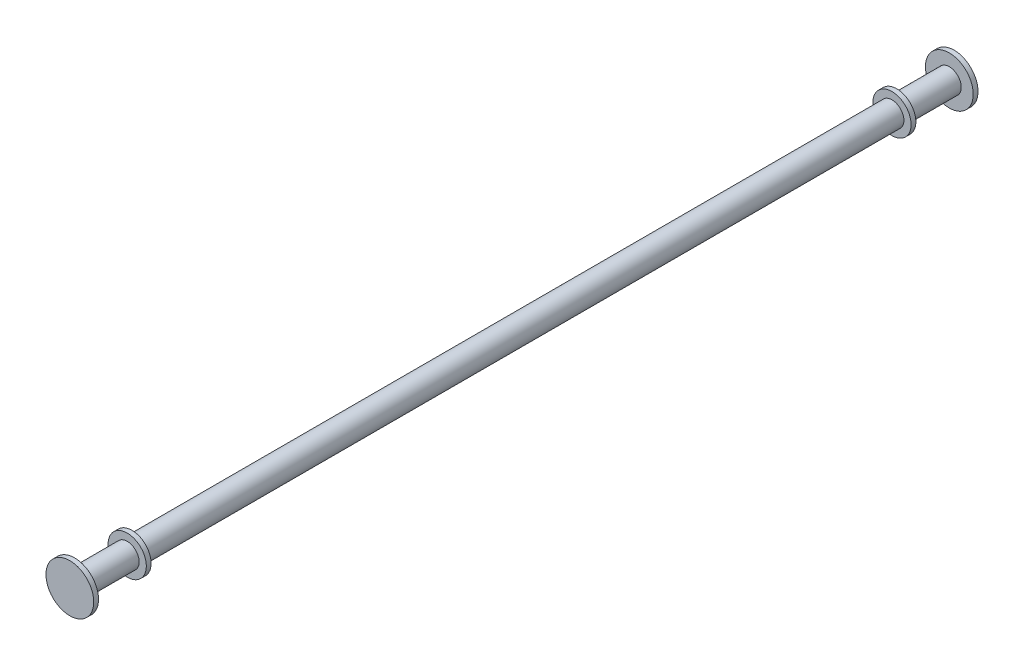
from build123d import *

# Parameters (mm, degrees)
SKETCH2_R           = 2.5
BOSS_EXTRUDE1_DEPTH = 185
SKETCH4_R           = 4
BOSS_EXTRUDE2_DEPTH = 1
SKETCH5_R           = 5
BOSS_EXTRUDE3_DEPTH = 1


with BuildPart() as part:
    # Sketch2 → Boss-Extrude1 (new body)
    with BuildSketch(Plane.XY):
        Circle(SKETCH2_R)
    extrude(amount=BOSS_EXTRUDE1_DEPTH)

    # Sketch4 → Boss-Extrude2 (add)
    with BuildSketch(Plane.XY.offset(172)):
        Circle(SKETCH4_R)
    boss_extrude2 = extrude(amount=BOSS_EXTRUDE2_DEPTH)

    # Mirror1: Boss-Extrude2 across plane
    add(boss_extrude2.mirror(Plane.XY.offset(92.5)))

    # Sketch5 → Boss-Extrude3 (add)
    with BuildSketch(Plane.XY.offset(184)):
        Circle(SKETCH5_R)
    boss_extrude3 = extrude(amount=BOSS_EXTRUDE3_DEPTH)

    # Mirror2: Boss-Extrude3 across plane
    add(boss_extrude3.mirror(Plane.XY.offset(92.5)))


solid = part.part
